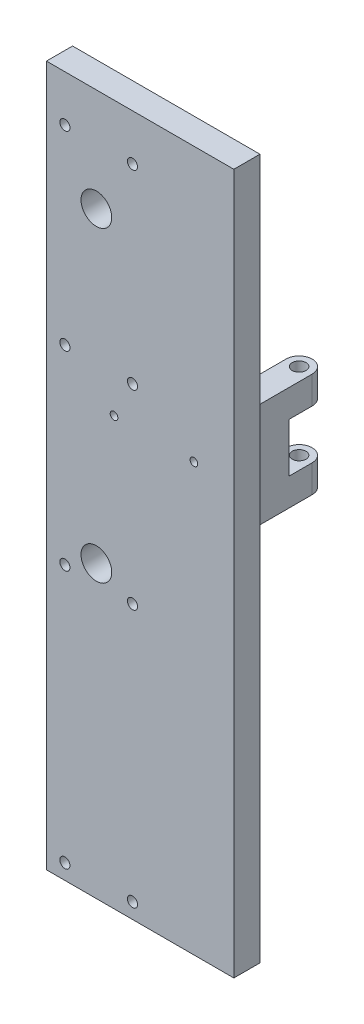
from build123d import *

# Parameters (mm, degrees)
ESQUISSE1_W             = 122
ESQUISSE1_H             = 68
EXTRUSION1_DEPTH        = 17
TROU_TARAUD_M61_D       = 5
ESQUISSE6_R             = 4.5
EXTRUSION2_DEPTH        = 18
ESQUISSE7_W             = 22
ESQUISSE7_H             = 32
EXTRUSION3_DEPTH        = 17
ESQUISSE8_W             = 122
ESQUISSE8_H             = 144
ESQUISSE8_H_2           = 244
EXTRUSION4_DEPTH        = 17
D_GAGEMENT_M61_D        = 6.6
ESQUISSE9_R             = 10
ENL_V_MAT_EXTRU_1_DEPTH = 280.868272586


with BuildPart() as part:
    # Esquisse1 → Extrusion1 (new body)
    with BuildSketch(Plane.XY):
        with Locations((61, 34)):
            Rectangle(ESQUISSE1_W, ESQUISSE1_H)
    extrude(amount=EXTRUSION1_DEPTH)

    # Trou taraud_ M61 (through all)
    with Locations(Plane.XY.offset(17)):
        with Locations((44, 34), (96, 34)):
            Hole(TROU_TARAUD_M61_D / 2)

    # Esquisse6 → Extrusion2 (add)
    with BuildSketch(Plane.XZ):
        with BuildLine():
            Line((119, 0), (119, -37))
            ThreePointArc((119, -37), (110.5, -45.5), (102, -37))
            Line((102, -37), (102, 0))
            Line((102, 0), (119, 0))
        make_face()
        with Locations(Location((110.5, -37, 0), (0, 0, 270))):
            Circle(ESQUISSE6_R, mode=Mode.SUBTRACT)
    extrusion2 = extrude(amount=-EXTRUSION2_DEPTH)

    # Sym_trie1: Extrusion2 across plane
    add(extrusion2.mirror(Plane(origin=(0, 34, 0), x_dir=(0, 0, 1), z_dir=(0, -1, 0))))

    # Esquisse7 → Extrusion3 (add)
    with BuildSketch(Plane(origin=(119, 0, 0), x_dir=(0, 0, -1), z_dir=(1, 0, 0))):
        with Locations((11, 34)):
            Rectangle(ESQUISSE7_W, ESQUISSE7_H)
    extrude(amount=-EXTRUSION3_DEPTH)

    # Esquisse8 → Extrusion4 (add)
    with BuildSketch(Plane.XY.offset(17)):
        with Locations((61, 140)):
            Rectangle(ESQUISSE8_W, ESQUISSE8_H)
        with Locations((61, -122)):
            Rectangle(ESQUISSE8_W, ESQUISSE8_H_2)
    extrude(amount=-EXTRUSION4_DEPTH)

    # D_gagement M61 (through all)
    with Locations(Plane.XY.offset(17)):
        with Locations((12, 58), (56, 58), (56, -66), (12, -66), (12, -234), (56, -234), (12, 182), (56, 182)):
            Hole(D_GAGEMENT_M61_D / 2)

    # Esquisse9 → Enl_v. mat.-Extru.1 (cut, through all)
    with BuildSketch(Plane.XY.offset(17)):
        with Locations((32.5, -55)):
            Circle(ESQUISSE9_R)
        with Locations((32.5, 145)):
            Circle(ESQUISSE9_R)
    extrude(amount=-ENL_V_MAT_EXTRU_1_DEPTH, mode=Mode.SUBTRACT)


solid = part.part
